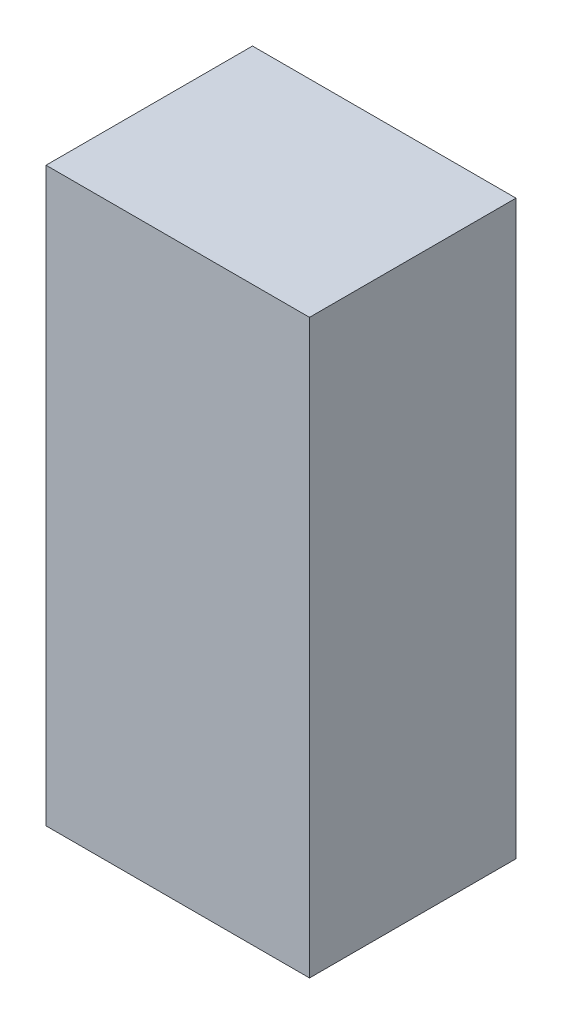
ISO-10303-21;
HEADER;
FILE_DESCRIPTION(('STEP AP214'),'2;1');
FILE_NAME('part.step','',(''),(''),'','','');
FILE_SCHEMA(('AUTOMOTIVE_DESIGN { 1 0 10303 214 1 1 1 1 }'));
ENDSEC;
DATA;
#1=APPLICATION_CONTEXT('core data for automotive mechanical design processes');
#2=APPLICATION_PROTOCOL_DEFINITION('international standard','automotive_design',2000,#1);
#3=PRODUCT_CONTEXT('',#1,'mechanical');
#4=PRODUCT('Part','Part','',(#3));
#5=PRODUCT_RELATED_PRODUCT_CATEGORY('part','',(#4));
#6=PRODUCT_DEFINITION_FORMATION('','',#4);
#7=PRODUCT_DEFINITION_CONTEXT('part definition',#1,'design');
#8=PRODUCT_DEFINITION('design','',#6,#7);
#9=PRODUCT_DEFINITION_SHAPE('','',#8);
#10=(LENGTH_UNIT() NAMED_UNIT(*) SI_UNIT(.MILLI.,.METRE.));
#11=(NAMED_UNIT(*) PLANE_ANGLE_UNIT() SI_UNIT($,.RADIAN.));
#12=(NAMED_UNIT(*) SI_UNIT($,.STERADIAN.) SOLID_ANGLE_UNIT());
#13=UNCERTAINTY_MEASURE_WITH_UNIT(LENGTH_MEASURE(1.E-05),#10,'distance_accuracy_value','');
#14=(GEOMETRIC_REPRESENTATION_CONTEXT(3) GLOBAL_UNCERTAINTY_ASSIGNED_CONTEXT((#13)) GLOBAL_UNIT_ASSIGNED_CONTEXT((#10,
#11,#12)) REPRESENTATION_CONTEXT('',''));
#15=CARTESIAN_POINT('',(0.,0.,0.));
#16=DIRECTION('',(0.,0.,1.));
#17=DIRECTION('',(1.,0.,0.));
#18=AXIS2_PLACEMENT_3D('',#15,#16,#17);
#19=CARTESIAN_POINT('',(0.70000114,-1.5199995,1.097));
#20=DIRECTION('',(0.,0.,-1.));
#21=DIRECTION('',(-1.,0.,0.));
#22=AXIS2_PLACEMENT_3D('',#19,#20,#21);
#23=PLANE('',#22);
#24=DIRECTION('',(1.,0.,0.));
#25=VECTOR('',#24,1.);
#26=CARTESIAN_POINT('',(0.70000114,1.5199995,1.097));
#27=LINE('',#26,#25);
#28=CARTESIAN_POINT('',(0.70000114,1.5199995,1.097));
#29=VERTEX_POINT('',#28);
#30=CARTESIAN_POINT('',(-0.6999986,1.5199995,1.097));
#31=VERTEX_POINT('',#30);
#32=EDGE_CURVE('E55',#29,#31,#27,.F.);
#33=ORIENTED_EDGE('',*,*,#32,.T.);
#34=DIRECTION('',(0.,1.,0.));
#35=VECTOR('',#34,1.);
#36=CARTESIAN_POINT('',(-0.6999986,1.5199995,1.097));
#37=LINE('',#36,#35);
#38=CARTESIAN_POINT('',(-0.6999986,-1.5199995,1.097));
#39=VERTEX_POINT('',#38);
#40=EDGE_CURVE('E57',#31,#39,#37,.F.);
#41=ORIENTED_EDGE('',*,*,#40,.T.);
#42=DIRECTION('',(1.,0.,0.));
#43=VECTOR('',#42,1.);
#44=CARTESIAN_POINT('',(-0.6999986,-1.5199995,1.097));
#45=LINE('',#44,#43);
#46=CARTESIAN_POINT('',(0.70000114,-1.5199995,1.097));
#47=VERTEX_POINT('',#46);
#48=EDGE_CURVE('E20',#39,#47,#45,.T.);
#49=ORIENTED_EDGE('',*,*,#48,.T.);
#50=DIRECTION('',(0.,1.,0.));
#51=VECTOR('',#50,1.);
#52=CARTESIAN_POINT('',(0.70000114,-1.5199995,1.097));
#53=LINE('',#52,#51);
#54=EDGE_CURVE('E80',#47,#29,#53,.T.);
#55=ORIENTED_EDGE('',*,*,#54,.T.);
#56=EDGE_LOOP('',(#33,#41,#49,#55));
#57=FACE_BOUND('',#56,.T.);
#58=ADVANCED_FACE('F17',(#57),#23,.F.);
#59=CARTESIAN_POINT('',(-0.6999986,-1.5199995,0.));
#60=DIRECTION('',(0.,1.,0.));
#61=DIRECTION('',(0.,0.,1.));
#62=AXIS2_PLACEMENT_3D('',#59,#60,#61);
#63=PLANE('',#62);
#64=DIRECTION('',(0.,0.,1.));
#65=VECTOR('',#64,1.);
#66=CARTESIAN_POINT('',(0.70000114,-1.5199995,0.));
#67=LINE('',#66,#65);
#68=CARTESIAN_POINT('',(0.70000114,-1.5199995,0.));
#69=VERTEX_POINT('',#68);
#70=EDGE_CURVE('E68',#69,#47,#67,.T.);
#71=ORIENTED_EDGE('',*,*,#70,.T.);
#72=ORIENTED_EDGE('',*,*,#48,.F.);
#73=DIRECTION('',(0.,0.,-1.));
#74=VECTOR('',#73,1.);
#75=CARTESIAN_POINT('',(-0.6999986,-1.5199995,0.));
#76=LINE('',#75,#74);
#77=CARTESIAN_POINT('',(-0.6999986,-1.5199995,0.));
#78=VERTEX_POINT('',#77);
#79=EDGE_CURVE('E63',#39,#78,#76,.T.);
#80=ORIENTED_EDGE('',*,*,#79,.T.);
#81=DIRECTION('',(-1.,0.,0.));
#82=VECTOR('',#81,1.);
#83=CARTESIAN_POINT('',(0.70000114,-1.5199995,0.));
#84=LINE('',#83,#82);
#85=EDGE_CURVE('E83',#69,#78,#84,.T.);
#86=ORIENTED_EDGE('',*,*,#85,.F.);
#87=EDGE_LOOP('',(#71,#72,#80,#86));
#88=FACE_BOUND('',#87,.T.);
#89=ADVANCED_FACE('F65',(#88),#63,.F.);
#90=CARTESIAN_POINT('',(-0.6999986,1.5199995,0.));
#91=DIRECTION('',(1.,0.,0.));
#92=DIRECTION('',(0.,0.,-1.));
#93=AXIS2_PLACEMENT_3D('',#90,#91,#92);
#94=PLANE('',#93);
#95=ORIENTED_EDGE('',*,*,#79,.F.);
#96=ORIENTED_EDGE('',*,*,#40,.F.);
#97=DIRECTION('',(0.,0.,-1.));
#98=VECTOR('',#97,1.);
#99=CARTESIAN_POINT('',(-0.6999986,1.5199995,0.));
#100=LINE('',#99,#98);
#101=CARTESIAN_POINT('',(-0.6999986,1.5199995,0.));
#102=VERTEX_POINT('',#101);
#103=EDGE_CURVE('E75',#31,#102,#100,.T.);
#104=ORIENTED_EDGE('',*,*,#103,.T.);
#105=DIRECTION('',(0.,1.,0.));
#106=VECTOR('',#105,1.);
#107=CARTESIAN_POINT('',(-0.6999986,-1.5199995,0.));
#108=LINE('',#107,#106);
#109=EDGE_CURVE('E72',#78,#102,#108,.T.);
#110=ORIENTED_EDGE('',*,*,#109,.F.);
#111=EDGE_LOOP('',(#95,#96,#104,#110));
#112=FACE_BOUND('',#111,.T.);
#113=ADVANCED_FACE('F70',(#112),#94,.F.);
#114=CARTESIAN_POINT('',(0.70000114,1.5199995,0.));
#115=DIRECTION('',(0.,-1.,0.));
#116=DIRECTION('',(0.,0.,-1.));
#117=AXIS2_PLACEMENT_3D('',#114,#115,#116);
#118=PLANE('',#117);
#119=ORIENTED_EDGE('',*,*,#103,.F.);
#120=ORIENTED_EDGE('',*,*,#32,.F.);
#121=DIRECTION('',(0.,0.,1.));
#122=VECTOR('',#121,1.);
#123=CARTESIAN_POINT('',(0.70000114,1.5199995,0.));
#124=LINE('',#123,#122);
#125=CARTESIAN_POINT('',(0.70000114,1.5199995,0.));
#126=VERTEX_POINT('',#125);
#127=EDGE_CURVE('E35',#29,#126,#124,.F.);
#128=ORIENTED_EDGE('',*,*,#127,.T.);
#129=DIRECTION('',(-1.,0.,0.));
#130=VECTOR('',#129,1.);
#131=CARTESIAN_POINT('',(0.70000114,1.5199995,0.));
#132=LINE('',#131,#130);
#133=EDGE_CURVE('E26',#102,#126,#132,.F.);
#134=ORIENTED_EDGE('',*,*,#133,.F.);
#135=EDGE_LOOP('',(#119,#120,#128,#134));
#136=FACE_BOUND('',#135,.T.);
#137=ADVANCED_FACE('F89',(#136),#118,.F.);
#138=CARTESIAN_POINT('',(0.70000114,-1.5199995,0.));
#139=DIRECTION('',(-1.,0.,0.));
#140=DIRECTION('',(0.,0.,1.));
#141=AXIS2_PLACEMENT_3D('',#138,#139,#140);
#142=PLANE('',#141);
#143=ORIENTED_EDGE('',*,*,#127,.F.);
#144=ORIENTED_EDGE('',*,*,#54,.F.);
#145=ORIENTED_EDGE('',*,*,#70,.F.);
#146=DIRECTION('',(0.,1.,0.));
#147=VECTOR('',#146,1.);
#148=CARTESIAN_POINT('',(0.70000114,-1.5199995,0.));
#149=LINE('',#148,#147);
#150=EDGE_CURVE('E11',#126,#69,#149,.F.);
#151=ORIENTED_EDGE('',*,*,#150,.F.);
#152=EDGE_LOOP('',(#143,#144,#145,#151));
#153=FACE_BOUND('',#152,.T.);
#154=ADVANCED_FACE('F91',(#153),#142,.F.);
#155=CARTESIAN_POINT('',(0.70000114,-1.5199995,0.));
#156=DIRECTION('',(0.,0.,-1.));
#157=DIRECTION('',(-1.,0.,0.));
#158=AXIS2_PLACEMENT_3D('',#155,#156,#157);
#159=PLANE('',#158);
#160=ORIENTED_EDGE('',*,*,#133,.T.);
#161=ORIENTED_EDGE('',*,*,#150,.T.);
#162=ORIENTED_EDGE('',*,*,#85,.T.);
#163=ORIENTED_EDGE('',*,*,#109,.T.);
#164=EDGE_LOOP('',(#160,#161,#162,#163));
#165=FACE_BOUND('',#164,.T.);
#166=ADVANCED_FACE('F88',(#165),#159,.T.);
#167=CLOSED_SHELL('',(#58,#89,#113,#137,#154,#166));
#168=MANIFOLD_SOLID_BREP('B1',#167);
#169=ADVANCED_BREP_SHAPE_REPRESENTATION('',(#18,#168),#14);
#170=SHAPE_DEFINITION_REPRESENTATION(#9,#169);
ENDSEC;
END-ISO-10303-21;
